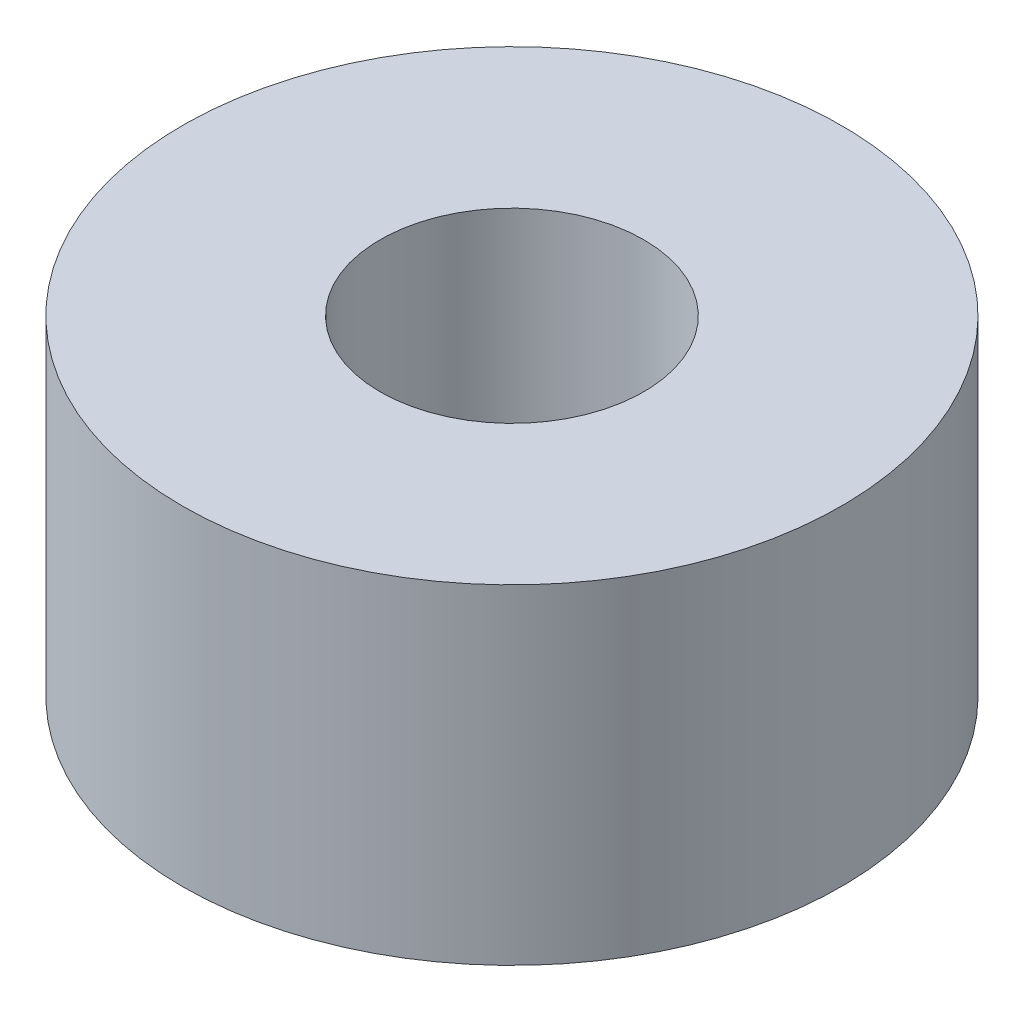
from build123d import *

# Parameters (mm, degrees)
SKETCH1_R           = 20
BOSS_EXTRUDE1_DEPTH = 20
SKETCH2_R           = 8
CUT_EXTRUDE1_DEPTH  = 35.641016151


with BuildPart() as part:
    # Sketch1 → Boss-Extrude1 (new body)
    with BuildSketch(Plane(origin=(0, 0, 0), x_dir=(1, 0, 0), z_dir=(0, 1, 0))):
        with Locations(Location((0, 0, 0), (0, 0, 270))):
            Circle(SKETCH1_R)
    extrude(amount=BOSS_EXTRUDE1_DEPTH)

    # Sketch2 → Cut-Extrude1 (cut, through all)
    with BuildSketch(Plane(origin=(0, 20, 0), x_dir=(1, 0, 0), z_dir=(0, 1, 0))):
        with Locations(Location((0, 0, 0), (0, 0, 270))):
            Circle(SKETCH2_R)
    extrude(amount=-CUT_EXTRUDE1_DEPTH, mode=Mode.SUBTRACT)


solid = part.part
